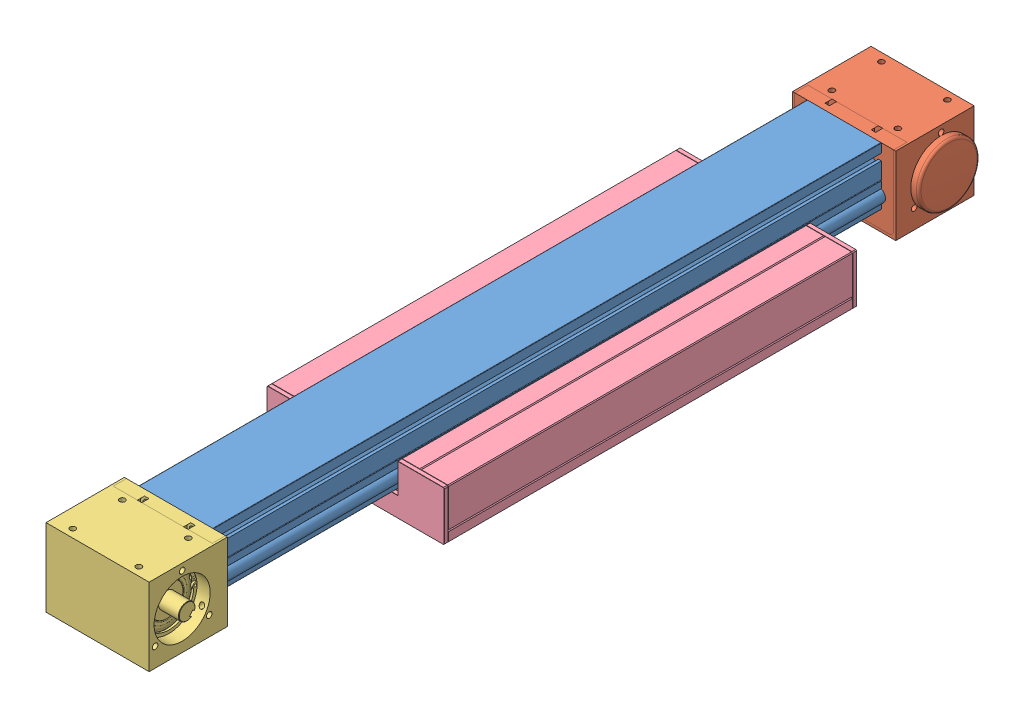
SolidWorks assembly MZK090_500_1000.SLDASM, configuration Standard (file format 12000). Lengths in mm.
Overall size (215 95 1000).
4 component instances, 4 part files, 8 mates.
Components (placement in the parent):
- Profil_MZ090-1: Profil_MZ090.SLDPRT [l=810] at origin size (100.1 81.5 810)
- Achskopf MZK090_ohne_Zapfen-1: Achskopf MZK090_ohne_Zapfen.SLDPRT [Standard] at (0 -13 -55) x (0 0 -1) z (-1 0 0) size (95 94 146.5)
- Achskopf MZK090_0-1: Achskopf MZK090_0.SLDPRT [Standard] at (0 -13 865) x (0 0 1) z (1 0 0) size (95 94 137)
- Schlitten_MZK090_500-1: Schlitten_MZK090_500.SLDPRT [Standard] at (0 35 342.2769) x (-1 0 0) z (0 0 1) size (215 60 500)
Mates (geometry in assembly coordinates):
- Deckungsgleich1: coincident aligned: plane of Achskopf MZK090_ohne_Zapfen-1 through (-62.5 35 0) normal (0 1 0); plane of Profil_MZ090-1 through (-45 35 810) normal (0 1 0)
- Deckungsgleich2: coincident anti-aligned: plane of Profil_MZ090-1 through (-45 35 0) normal (0 0 -1); plane of Achskopf MZK090_ohne_Zapfen-1 through (54 -50 0) normal (0 0 1)
- Breite1: width anti-aligned: plane of Achskopf MZK090_ohne_Zapfen-1 through (-62.5 -59 0) normal (-1 0 0); plane of Achskopf MZK090_ohne_Zapfen-1 through (62.5 -59 0) normal (1 0 0); plane of Profil_MZ090-1 through (45 35 810) normal (1 0 0); plane of Profil_MZ090-1 through (-45 35 810) normal (-1 0 0)
- Deckungsgleich3: coincident aligned: plane of Achskopf MZK090_0-1 through (62.5 35 810) normal (0 1 0); plane of Profil_MZ090-1 through (-45 35 810) normal (0 1 0)
- Deckungsgleich4: coincident anti-aligned: plane of Achskopf MZK090_0-1 through (-54 -50 810) normal (0 0 -1); plane of Profil_MZ090-1 through (-45 35 810) normal (0 0 1)
- Breite2: width anti-aligned: plane of Achskopf MZK090_0-1 through (-62.5 -59 810) normal (-1 0 0); plane of Achskopf MZK090_0-1 through (62.5 -59 810) normal (1 0 0); plane of Profil_MZ090-1 through (45 35 810) normal (1 0 0); plane of Profil_MZ090-1 through (-45 35 810) normal (-1 0 0)
- Abstand1: distance = 95 mm anti-aligned: plane of Profil_MZ090-1 through (-45 35 810) normal (0 1 0); plane of Schlitten_MZK090_500-1 through (-107.5 -60 587.2769) normal (0 -1 0)
- Breite3: width anti-aligned: plane of Schlitten_MZK090_500-1 through (-107.5 -60 587.2769) normal (-1 0 0); plane of Schlitten_MZK090_500-1 through (107.5 -60 587.2769) normal (1 0 0); plane of Profil_MZ090-1 through (45 35 810) normal (1 0 0); plane of Profil_MZ090-1 through (-45 35 810) normal (-1 0 0)
